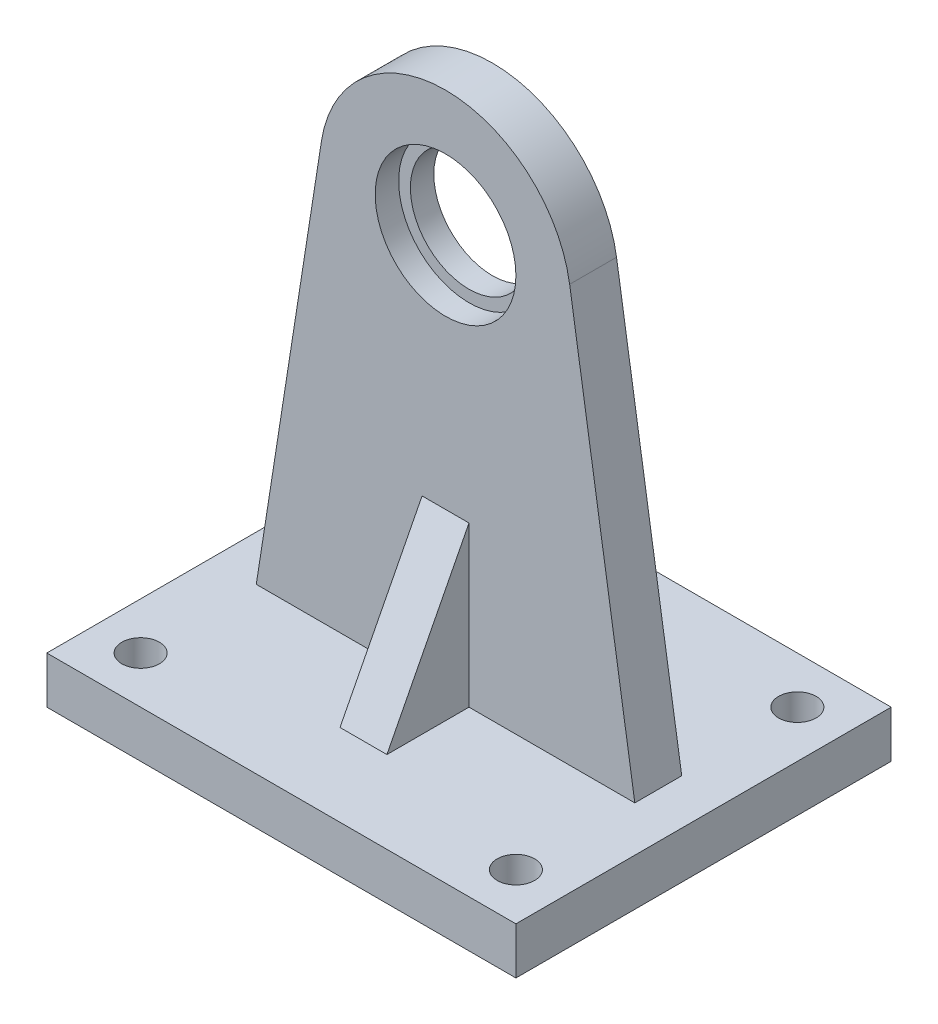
from build123d import *

# Parameters (mm, degrees)
SKETCH1_W          = 63.5
SKETCH1_H          = 50.8
EXTRUDE1_DEPTH     = 6.35
EXTRUDE2_DEPTH     = 3.175
EXTRUDE3_DEPTH     = 3.175
SKETCH4_R          = 9.525
CUT_EXTRUDE1_DEPTH = 3.175
SKETCH5_R          = 7.9375
CUT_EXTRUDE2_DEPTH = 88.167733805
SKETCH6_R          = 2.54
CUT_EXTRUDE3_DEPTH = 82.604647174


with BuildPart() as part:
    # Sketch1 → Extrude1 (new body)
    with BuildSketch(Plane(origin=(0, 0, 0), x_dir=(1, 0, 0), z_dir=(0, 1, 0))):
        Rectangle(SKETCH1_W, SKETCH1_H)
    extrude(amount=EXTRUDE1_DEPTH)

    # Sketch2 → Extrude2 (add, symmetric)
    with BuildSketch(Plane.XY):
        with BuildLine():
            Line((-25.620677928, 6.35), (-16.797663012, 62.730350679))
            ThreePointArc((-16.797663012, 62.730350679), (0, 77.103769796), (16.797663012, 62.730350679))
            Line((16.797663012, 62.730350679), (25.620677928, 6.35))
            Line((25.620677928, 6.35), (-25.620677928, 6.35))
        make_face()
    extrude(amount=EXTRUDE2_DEPTH, both=True)

    # Sketch3 → Extrude3 (add, symmetric)
    with BuildSketch(Plane(origin=(0, 0, 0), x_dir=(0, 0, -1), z_dir=(1, 0, 0))):
        Polygon((-14.2875, 6.35), (-3.175, 27.94), (3.175, 27.94), (14.2875, 6.35), align=None)
    extrude(amount=EXTRUDE3_DEPTH, both=True)

    # Sketch4 → Cut-Extrude1 (cut)
    with BuildSketch(Plane.XY.offset(3.175)):
        with Locations((0, 60.101668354)):
            Circle(SKETCH4_R)
    extrude(amount=-CUT_EXTRUDE1_DEPTH, mode=Mode.SUBTRACT)

    # Sketch5 → Cut-Extrude2 (cut, through all)
    with BuildSketch(Plane.XY):
        with Locations((0, 60.101668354)):
            Circle(SKETCH5_R)
    extrude(amount=-CUT_EXTRUDE2_DEPTH, mode=Mode.SUBTRACT)

    # Sketch6 → Cut-Extrude3 (cut, through all)
    with BuildSketch(Plane(origin=(0, 6.35, 0), x_dir=(-1, 0, 0), z_dir=(0, 1, 0))):
        with Locations(Location((25.4, 19.05, 0), (0, 0, 90))):
            Circle(SKETCH6_R)
        with Locations(Location((-25.4, 19.05, 0), (0, 0, 270))):
            Circle(SKETCH6_R)
        with Locations(Location((-25.4, -19.05, 0), (0, 0, 90))):
            Circle(SKETCH6_R)
        with Locations(Location((25.4, -19.05, 0), (0, 0, 270))):
            Circle(SKETCH6_R)
    extrude(amount=-CUT_EXTRUDE3_DEPTH, mode=Mode.SUBTRACT)


solid = part.part
